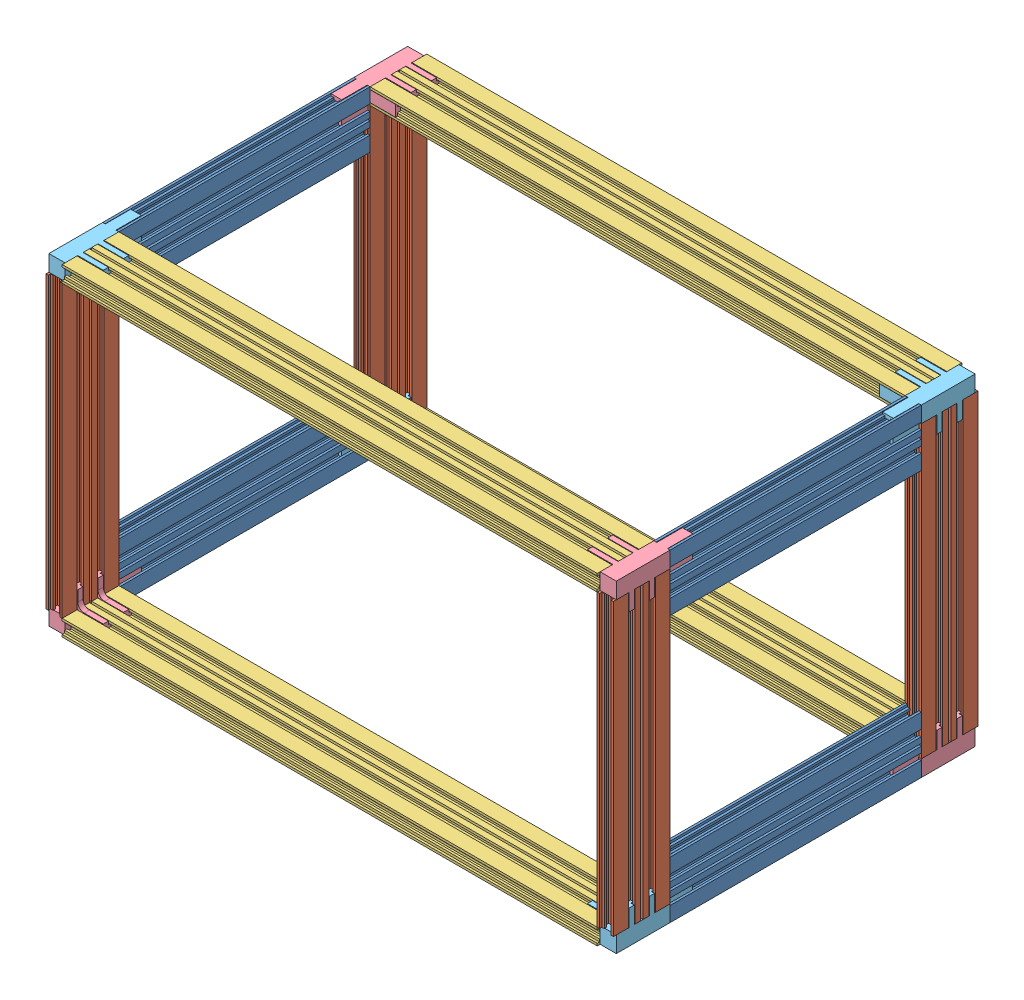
SolidWorks assembly Blades with Connectios ASM.SLDASM, configuration Default (file format 9000). Lengths in mm.
Overall size (445 253 285.9).
20 component instances, 5 part files, 58 mates.
Components (placement in the parent):
- Blade1-1: Blade1.SLDPRT [Default] at (114.7807 102.2962 48.6134) x (0 1 0) z (0 0 -1) size (44.45 12.7 197)
- Blade2-1: Blade2.SLDPRT [Default] at (114.7807 111.8212 -170.6116) x (0 0 -1) z (0 -1 0) size (44.45 12.7 227.6)
- Blade3-2: Blade3.SLDPRT [Default] at (121.1307 -122.1288 -170.6116) x (0 0 -1) z (1 0 0) size (44.45 12.7 419.6)
- Blade3-6: Blade3.SLDPRT [Default] at (121.1307 118.1712 -170.6116) x (0 0 -1) z (1 0 0) size (44.45 12.7 419.6)
- Blade3-7: Blade3.SLDPRT [Default] at (121.1307 -122.1288 70.8384) x (0 0 -1) z (1 0 0) size (44.45 12.7 419.6)
- Blade3-8: Blade3.SLDPRT [Default] at (121.1307 118.1712 70.8384) x (0 0 -1) z (1 0 0) size (44.45 12.7 419.6)
- Blade1-2: Blade1.SLDPRT [Default] at (114.7807 -106.2538 48.6134) x (0 1 0) z (0 0 -1) size (44.45 12.7 197)
- Blade1-3: Blade1.SLDPRT [Default] at (547.0807 -106.2538 48.6134) x (0 1 0) z (0 0 -1) size (44.45 12.7 197)
- Blade1-4: Blade1.SLDPRT [Default] at (547.0807 102.2962 48.6134) x (0 1 0) z (0 0 -1) size (44.45 12.7 197)
- Blade2-2: Blade2.SLDPRT [Default] at (547.0807 111.8212 -170.6116) x (0 0 -1) z (0 -1 0) size (44.45 12.7 227.6)
- Blade2-3: Blade2.SLDPRT [Default] at (114.7807 111.8212 70.8384) x (0 0 -1) z (0 -1 0) size (44.45 12.7 227.6)
- Blade2-4: Blade2.SLDPRT [Default] at (547.0807 111.8212 70.8384) x (0 0 -1) z (0 -1 0) size (44.45 12.7 227.6)
- Corner Connection Left-1: Corner Connection Left.SLDPRT [Default] at (113.813 134.5641 -192.8266) x (0 -1 0) z (0 0 1) size (25.97 32.7 62.2)
- Corner Connection Right-1: Corner Connection Right.SLDPRT [Default] at (548.0483 -123.0359 93.0534) x (0 -1 0) z (0 0 -1) size (25.97 32.7 62.2)
- Corner Connection Left-2: Corner Connection Left.SLDPRT [Default] at (113.813 -138.5216 93.0534) x (0 1 0) z (0 0 -1) size (25.97 32.7 62.2)
- Corner Connection Left-3: Corner Connection Left.SLDPRT [Default] at (548.0483 -138.5216 -192.8266) x (0 1 0) z (0 0 1) size (25.97 32.7 62.2)
- Corner Connection Left-4: Corner Connection Left.SLDPRT [Default] at (548.0483 134.5641 93.0534) x (0 -1 0) z (0 0 -1) size (25.97 32.7 62.2)
- Corner Connection Right-2: Corner Connection Right.SLDPRT [Default] at (548.0483 119.0784 -192.8266) x (0 1 0) z (0 0 1) size (25.97 32.7 62.2)
- Corner Connection Right-3: Corner Connection Right.SLDPRT [Default] at (113.813 -123.0359 -192.8266) x (0 -1 0) z (0 0 1) size (25.97 32.7 62.2)
- Corner Connection Right-4: Corner Connection Right.SLDPRT [Default] at (113.813 119.0784 93.0534) x (0 1 0) z (0 0 -1) size (25.97 32.7 62.2)
Mates (geometry in assembly coordinates):
- Coincident1: coincident aligned: plane of Blade1-1 through (114.7807 102.2962 -148.3866) normal (0 0 -1); plane of Blade1-4 through (547.0807 102.2962 -148.3866) normal (0 0 -1)
- Coincident2: coincident aligned: plane of Blade1-1 through (114.7807 102.2962 -148.3866) normal (0 0 -1); plane of Blade1-3 through (547.0807 -106.2538 -148.3866) normal (0 0 -1)
- Coincident3: coincident aligned: plane of Blade1-1 through (114.7807 102.2962 -148.3866) normal (0 0 -1); plane of Blade1-2 through (114.7807 -106.2538 -148.3866) normal (0 0 -1)
- Coincident4: coincident aligned: plane of Blade1-1 through (110.2307 124.5212 -148.3866) normal (0 1 0); plane of Blade1-4 through (542.5307 124.5212 -148.3866) normal (0 1 0)
- Coincident5: coincident aligned: plane of Blade1-2 through (121.1307 -128.4788 -148.3866) normal (0 -1 0); plane of Blade1-3 through (553.4307 -128.4788 -148.3866) normal (0 -1 0)
- Coincident6: coincident aligned: plane of Blade1-1 through (108.4307 80.0712 -148.3866) normal (-1 0 0); plane of Blade1-2 through (108.4307 -84.0288 -148.3866) normal (-1 0 0)
- Coincident7: coincident aligned: plane of Blade1-3 through (553.4307 -95.6538 -148.3866) normal (1 0 0); plane of Blade1-4 through (553.4307 91.6962 -148.3866) normal (1 0 0)
- Coincident8: coincident aligned: plane of Blade3-6 through (540.7307 124.5212 -181.2116) normal (0 1 0); plane of Blade3-8 through (540.7307 124.5212 60.2384) normal (0 1 0)
- Coincident11: coincident aligned: plane of Blade3-2 through (540.7307 -115.7788 -181.2116) normal (0 1 0); plane of Blade3-7 through (540.7307 -115.7788 60.2384) normal (0 1 0)
- Coincident12: coincident aligned: plane of Blade3-6 through (121.1307 118.1712 -170.6116) normal (-1 0 0); plane of Blade3-8 through (121.1307 118.1712 70.8384) normal (-1 0 0)
- Coincident13: coincident aligned: plane of Blade3-2 through (121.1307 -122.1288 -170.6116) normal (-1 0 0); plane of Blade3-6 through (121.1307 118.1712 -170.6116) normal (-1 0 0)
- Coincident14: coincident aligned: plane of Blade3-6 through (121.1307 118.1712 -170.6116) normal (-1 0 0); plane of Blade3-7 through (121.1307 -122.1288 70.8384) normal (-1 0 0)
- Coincident15: coincident aligned: plane of Blade2-1 through (108.4307 -115.7788 -148.3866) normal (-1 0 0); plane of Blade2-3 through (108.4307 -115.7788 93.0634) normal (-1 0 0)
- Coincident16: coincident aligned: plane of Blade2-1 through (114.7807 111.8212 -170.6116) normal (0 1 0); plane of Blade2-3 through (114.7807 111.8212 70.8384) normal (0 1 0)
- Coincident17: coincident aligned: plane of Blade2-1 through (114.7807 111.8212 -170.6116) normal (0 1 0); plane of Blade2-2 through (547.0807 111.8212 -170.6116) normal (0 1 0)
- Coincident18: coincident aligned: plane of Blade2-1 through (114.7807 111.8212 -170.6116) normal (0 1 0); plane of Blade2-4 through (547.0807 111.8212 70.8384) normal (0 1 0)
- Coincident19: coincident aligned: plane of Blade2-2 through (553.4307 -115.7788 -181.2116) normal (1 0 0); plane of Blade2-4 through (553.4307 -115.7788 60.2384) normal (1 0 0)
- Coincident20: coincident aligned: plane of Blade2-3 through (108.4307 -115.7788 93.0634) normal (0 0 1); plane of Blade2-4 through (540.7307 -115.7788 93.0634) normal (0 0 1)
- Coincident21: coincident aligned: plane of Blade2-1 through (119.3307 -115.7788 -192.8366) normal (0 0 -1); plane of Blade2-2 through (551.6307 -115.7788 -192.8366) normal (0 0 -1)
- Coincident22: coincident aligned: plane of Blade3-2 through (540.7307 -117.5788 -192.8366) normal (0 0 -1); plane of Blade3-6 through (540.7307 122.7212 -192.8366) normal (0 0 -1)
- Coincident23: coincident aligned: plane of Blade3-7 through (540.7307 -115.7788 93.0634) normal (0 0 1); plane of Blade3-8 through (540.7307 124.5212 93.0634) normal (0 0 1)
- Coincident24: coincident anti-aligned: plane of Blade3-6 through (540.7307 111.8212 -192.8366) normal (0 -1 0); plane of Blade2-3 through (114.7807 111.8212 70.8384) normal (0 1 0)
- Coincident25: coincident anti-aligned: plane of Blade2-1 through (121.1307 -115.7788 -160.0116) normal (1 0 0); plane of Blade3-6 through (121.1307 118.1712 -170.6116) normal (-1 0 0)
- Coincident26: coincident anti-aligned: plane of Blade3-6 through (540.7307 118.1712 -170.6116) normal (1 0 0); plane of Blade2-2 through (540.7307 -115.7788 -192.8366) normal (-1 0 0)
- Coincident27: coincident anti-aligned: plane of Blade2-1 through (121.1307 -115.7788 -160.0116) normal (1 0 0); plane of Blade3-2 through (121.1307 -122.1288 -170.6116) normal (-1 0 0)
- Coincident28: coincident anti-aligned: plane of Blade2-1 through (114.7807 -115.7788 -170.6116) normal (0 -1 0); plane of Blade3-2 through (540.7307 -115.7788 -160.0116) normal (0 1 0)
- Coincident29: coincident aligned: plane of Blade3-8 through (540.7307 111.8212 93.0634) normal (0 0 1); plane of Blade2-3 through (121.1307 -115.7788 93.0634) normal (0 0 1)
- Coincident30: coincident aligned: plane of Blade3-6 through (540.7307 122.7212 -192.8366) normal (0 0 -1); plane of Blade2-2 through (551.6307 -115.7788 -192.8366) normal (0 0 -1)
- Coincident31: coincident aligned: plane of Blade1-1 through (108.4307 124.5212 -148.3866) normal (-1 0 0); plane of Blade2-1 through (108.4307 -115.7788 -192.8366) normal (-1 0 0)
- Coincident32: coincident aligned: plane of Blade1-1 through (110.2307 124.5212 -148.3866) normal (0 1 0); plane of Blade3-6 through (540.7307 124.5212 -160.0116) normal (0 1 0)
- Coincident33: coincident anti-aligned: plane of Blade1-1 through (114.7807 102.2962 -148.3866) normal (0 0 -1); plane of Blade2-1 through (108.4307 -115.7788 -148.3866) normal (0 0 1)
- Coincident34: coincident aligned: plane of Blade1-4 through (553.4307 112.8962 -148.3866) normal (1 0 0); plane of Blade2-2 through (553.4307 -115.7788 -160.0116) normal (1 0 0)
- Coincident35: coincident aligned: plane of Blade3-2 through (540.7307 -128.4788 -165.1116) normal (0 -1 0); plane of Blade1-2 through (108.4307 -128.4788 -148.3866) normal (0 -1 0)
- Coincident36: coincident anti-aligned: plane of Blade1-1 through (114.7807 102.2962 48.6134) normal (0 0 1); plane of Blade2-3 through (119.3307 -115.7788 48.6134) normal (0 0 -1)
- Coincident37: coincident aligned: plane of Blade3-6 through (540.7307 124.5212 -181.2116) normal (0 1 0); plane of Corner Connection Left-1 through (121.1307 124.5212 -148.3866) normal (0 1 0)
- Coincident38: coincident aligned: plane of Blade2-1 through (108.4307 -115.7788 -192.8366) normal (-1 0 0); plane of Corner Connection Left-1 through (108.4307 124.5212 -148.3866) normal (-1 0 0)
- Coincident39: coincident anti-aligned: plane of Blade1-1 through (114.7807 102.2962 -148.3866) normal (0 0 -1); plane of Corner Connection Left-1 through (113.813 119.0784 -148.3866) normal (0 0 1)
- Coincident40: coincident aligned: plane of Blade3-8 through (540.7307 124.5212 60.2384) normal (0 1 0); plane of Corner Connection Right-4 through (121.1307 124.5212 48.6134) normal (0 1 0)
- Coincident41: coincident aligned: plane of Blade2-3 through (108.4307 -115.7788 93.0634) normal (-1 0 0); plane of Corner Connection Right-4 through (108.4307 124.5212 48.6134) normal (-1 0 0)
- Coincident42: coincident anti-aligned: plane of Blade1-1 through (114.7807 102.2962 48.6134) normal (0 0 1); plane of Corner Connection Right-4 through (113.813 119.0784 48.6134) normal (0 0 -1)
- Coincident43: coincident aligned: plane of Blade3-2 through (540.7307 -128.4788 -148.3866) normal (0 -1 0); plane of Corner Connection Right-3 through (121.1307 -128.4788 -148.3866) normal (0 -1 0)
- Coincident44: coincident anti-aligned: plane of Blade1-2 through (114.7807 -106.2538 -148.3866) normal (0 0 -1); plane of Corner Connection Right-3 through (113.813 -123.0359 -148.3866) normal (0 0 1)
- Coincident45: coincident aligned: plane of Blade2-1 through (108.4307 -115.7788 -192.8366) normal (-1 0 0); plane of Corner Connection Right-3 through (108.4307 -128.4788 -148.3866) normal (-1 0 0)
- Coincident46: coincident aligned: plane of Blade3-7 through (540.7307 -128.4788 48.6134) normal (0 -1 0); plane of Corner Connection Left-2 through (121.1307 -128.4788 48.6134) normal (0 -1 0)
- Coincident47: coincident aligned: plane of Blade2-3 through (108.4307 -115.7788 93.0634) normal (-1 0 0); plane of Corner Connection Left-2 through (108.4307 -128.4788 48.6134) normal (-1 0 0)
- Coincident48: coincident anti-aligned: plane of Blade1-2 through (114.7807 -106.2538 48.6134) normal (0 0 1); plane of Corner Connection Left-2 through (113.813 -123.0359 48.6134) normal (0 0 -1)
- Coincident49: coincident aligned: plane of Blade1-3 through (553.4307 -116.8538 -148.3866) normal (1 0 0); plane of Corner Connection Left-3 through (553.4307 -128.4788 -148.3866) normal (1 0 0)
- Coincident50: coincident aligned: plane of Blade3-2 through (540.7307 -128.4788 -148.3866) normal (0 -1 0); plane of Corner Connection Left-3 through (540.7307 -128.4788 -148.3866) normal (0 -1 0)
- Coincident51: coincident anti-aligned: plane of Blade1-3 through (547.0807 -106.2538 -148.3866) normal (0 0 -1); plane of Corner Connection Left-3 through (548.0483 -123.0359 -148.3866) normal (0 0 1)
- Coincident52: coincident aligned: plane of Blade1-4 through (553.4307 112.8962 -148.3866) normal (1 0 0); plane of Corner Connection Left-4 through (553.4307 124.5212 48.6134) normal (1 0 0)
- Coincident53: coincident aligned: plane of Blade3-8 through (540.7307 124.5212 60.2384) normal (0 1 0); plane of Corner Connection Left-4 through (540.7307 124.5212 48.6134) normal (0 1 0)
- Coincident54: coincident anti-aligned: plane of Blade1-4 through (547.0807 102.2962 48.6134) normal (0 0 1); plane of Corner Connection Left-4 through (548.0483 119.0784 48.6134) normal (0 0 -1)
- Coincident55: coincident aligned: plane of Blade1-4 through (553.4307 112.8962 -148.3866) normal (1 0 0); plane of Corner Connection Right-2 through (553.4307 124.5212 -148.3866) normal (1 0 0)
- Coincident56: coincident aligned: plane of Blade3-6 through (540.7307 124.5212 -160.0116) normal (0 1 0); plane of Corner Connection Right-2 through (540.7307 124.5212 -148.3866) normal (0 1 0)
- Coincident57: coincident anti-aligned: plane of Blade1-4 through (547.0807 102.2962 -148.3866) normal (0 0 -1); plane of Corner Connection Right-2 through (548.0483 119.0784 -148.3866) normal (0 0 1)
- Coincident58: coincident aligned: plane of Blade3-7 through (540.7307 -128.4788 48.6134) normal (0 -1 0); plane of Corner Connection Right-1 through (540.7307 -128.4788 48.6134) normal (0 -1 0)
- Coincident59: coincident aligned: plane of Blade1-3 through (553.4307 -95.6538 -148.3866) normal (1 0 0); plane of Corner Connection Right-1 through (553.4307 -128.4788 48.6134) normal (1 0 0)
- Coincident60: coincident anti-aligned: plane of Blade1-3 through (547.0807 -106.2538 48.6134) normal (0 0 1); plane of Corner Connection Right-1 through (548.0483 -123.0359 48.6134) normal (0 0 -1)
